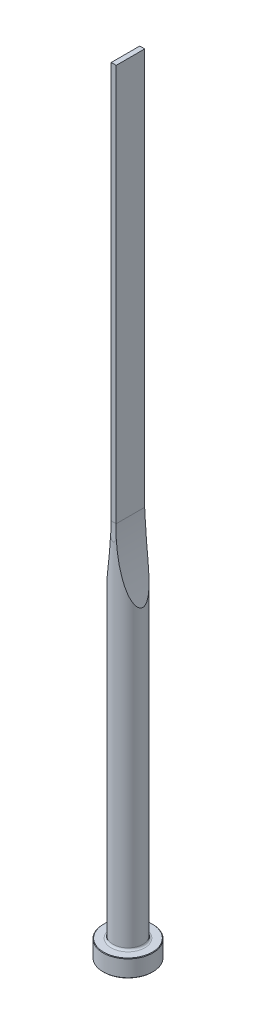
from build123d import *

# Parameters (mm, degrees)
CUT_EXTRUDE1_DEPTH = 7.5
CUT_EXTRUDE2_DEPTH = 7.5


with BuildPart() as part:
    # Sketch1 → Revolve1 (revolve)
    with BuildSketch(Plane.XY, mode=Mode.PRIVATE) as revolve1_sk:
        with BuildLine():
            Line((0, 0), (9.8, 0))
            Line((9.8, 0), (10, 0.2))
            Line((10, 0.2), (10, 6.8))
            Line((10, 6.8), (9.8, 7))
            Line((9.8, 7), (6.8, 7))
            ThreePointArc((6.8, 7), (6.234314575, 7.234314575), (6, 7.8))
            Line((6, 7.8), (6, 315))
            Line((6, 315), (0, 315))
            Line((0, 315), (0, 0))
        make_face()
    revolve(revolve1_sk.sketch.rotate(Axis((0, 315, 0), (0, -1, 0)), 180), axis=Axis((0, 315, 0), (0, -1, 0)))

    # Sketch2 → Cut-Extrude1 (cut, symmetric)
    with BuildSketch(Plane.XY):
        with BuildLine():
            Line((1, 315), (1, 155))
            ThreePointArc((1, 155), (2.258803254, 140), (6, 125.419601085))
            Line((6, 125.419601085), (6, 315))
            Line((6, 315), (1, 315))
        make_face()
        with BuildLine():
            Line((-1, 315), (-1, 155))
            ThreePointArc((-1, 155), (-2.258803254, 140), (-6, 125.419601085))
            Line((-6, 125.419601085), (-6, 315))
            Line((-6, 315), (-1, 315))
        make_face()
    extrude(amount=CUT_EXTRUDE1_DEPTH, both=True, mode=Mode.SUBTRACT)

    # Sketch3 → Cut-Extrude2 (cut, symmetric)
    with BuildSketch(Plane(origin=(0, 0, 0), x_dir=(0, 0, -1), z_dir=(1, 0, 0))):
        with BuildLine():
            Line((5.75, 315), (5.75, 155))
            ThreePointArc((5.75, 155), (5.812521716, 151.645898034), (6, 148.296456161))
            Line((6, 148.296456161), (6, 315))
            Line((6, 315), (5.75, 315))
        make_face()
        with BuildLine():
            Line((-5.75, 315), (-5.75, 155))
            ThreePointArc((-5.75, 155), (-5.812521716, 151.645898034), (-6, 148.296456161))
            Line((-6, 148.296456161), (-6, 315))
            Line((-6, 315), (-5.75, 315))
        make_face()
    extrude(amount=CUT_EXTRUDE2_DEPTH, both=True, mode=Mode.SUBTRACT)


solid = part.part
